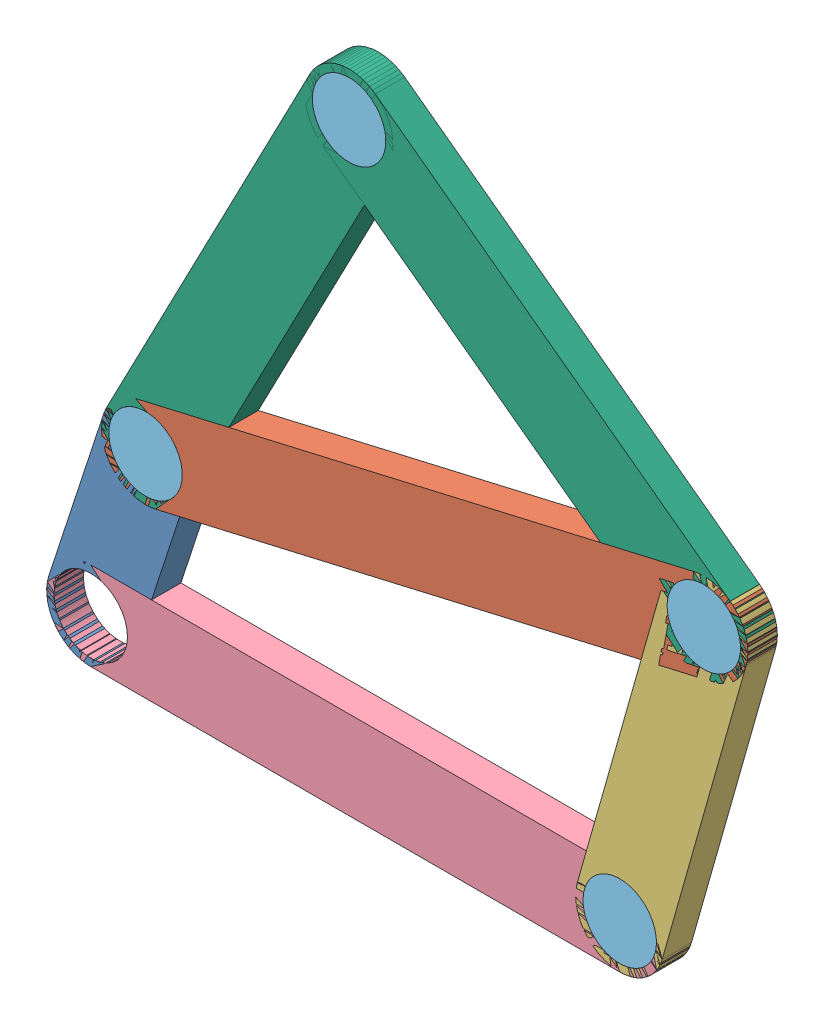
SolidWorks assembly Assem1.SLDASM, configuration Default (file format 15000). Lengths in mm.
Overall size (248.52 229.97 10).
10 component instances, 6 part files, 21 mates.
Components (placement in the parent):
- Part1-1: Part1.SLDPRT [Default] at (10.0607 72.169 89.371) x (-0.310807 -0.950473 0) z (0 0 1) size (90 30 10)
- Part2-1: Part2.SLDPRT [Default] at (200.0327 116.1647 89.371) x (-0.974216 -0.225619 0) z (0 0 1) size (225 30 10)
- Part4-1: Part4.SLDPRT [Default] at (200.0327 116.1647 89.371) x (-0.272576 -0.962134 0) z (0 0 1) size (135 30 10)
- Part6-1: Part6.SLDPRT [Default] at (-8.5877 15.1406 89.371) size (210 30 10)
- pin-5: pin.SLDPRT [Default] at (171.4123 15.1406 89.371) size (25 25 10)
- Part7-1: Part7.SLDPRT [Default] at (10.0607 72.169 89.371) x (0.461784 0.886992 0) z (0 0 1) size (180 30 10)
- Part7-2: Part7.SLDPRT [Default] at (79.3284 205.2178 89.371) x (0.804696 -0.593687 0) z (0 0 1) size (180 30 10)
- pin-6: pin.SLDPRT [Default] at (79.3284 205.2178 89.371) size (25 25 10)
- pin-7: pin.SLDPRT [Default] at (10.0607 72.169 89.371) size (25 25 10)
- pin-8: pin.SLDPRT [Default] at (200.0327 116.1647 89.371) size (25 25 10)
Mates (geometry in assembly coordinates):
- Concentric1: concentric aligned: cylinder of Part1-1 through (10.0607 72.169 99.371) axis (0 0 -1) radius 12.5; cylinder of Part2-1 through (10.0607 72.169 99.371) axis (0 0 -1) radius 12.5
- Coincident1: coincident aligned: plane of Part1-1 through (10.0607 72.169 99.371) normal (0 0 1); plane of Part2-1 through (200.0327 116.1647 99.371) normal (0 0 1)
- Concentric2: concentric aligned: cylinder of Part2-1 through (200.0327 116.1647 99.371) axis (0 0 -1) radius 12.5; cylinder of Part4-1 through (200.0327 116.1647 99.371) axis (0 0 -1) radius 12.5
- Coincident2: coincident aligned: plane of Part2-1 through (200.0327 116.1647 99.371) normal (0 0 1); plane of Part4-1 through (200.0327 116.1647 99.371) normal (0 0 1)
- Concentric7: concentric aligned: cylinder of Part1-1 through (-8.5877 15.1406 99.371) axis (0 0 -1) radius 12.5; cylinder of Part6-1 through (-8.5877 15.1406 99.371) axis (0 0 -1) radius 12.5
- Concentric8: concentric aligned: cylinder of Part4-1 through (171.4123 15.1406 99.371) axis (0 0 -1) radius 12.5; cylinder of Part6-1 through (171.4123 15.1406 99.371) axis (0 0 -1) radius 12.5
- Coincident10: coincident aligned: plane of Part4-1 through (200.0327 116.1647 99.371) normal (0 0 1); plane of Part6-1 through (-8.5877 15.1406 99.371) normal (0 0 1)
- Coincident11: coincident aligned: plane of Part1-1 through (10.0607 72.169 99.371) normal (0 0 1); plane of Part6-1 through (-8.5877 15.1406 99.371) normal (0 0 1)
- Concentric9: concentric aligned: cylinder of Part6-1 through (171.4123 15.1406 99.371) axis (0 0 -1) radius 12.5; cylinder of pin-5 through (171.4123 15.1406 99.371) axis (0 0 -1) radius 12.5
- Coincident12: coincident aligned: plane of Part6-1 through (-8.5877 15.1406 99.371) normal (0 0 1); plane of pin-5 through (171.4123 15.1406 99.371) normal (0 0 1)
- Concentric10: concentric aligned: cylinder of Part1-1 through (10.0607 72.169 99.371) axis (0 0 -1) radius 12.5; cylinder of Part7-1 through (10.0607 72.169 99.371) axis (0 0 -1) radius 12.5
- Coincident13: coincident aligned: plane of Part2-1 through (200.0327 116.1647 99.371) normal (0 0 1); plane of Part7-1 through (10.0607 72.169 99.371) normal (0 0 1)
- Concentric11: concentric aligned: cylinder of Part7-1 through (79.3284 205.2178 99.371) axis (0 0 -1) radius 12.5; cylinder of Part7-2 through (79.3284 205.2178 99.371) axis (0 0 -1) radius 12.5
- Coincident14: coincident aligned: plane of Part7-1 through (10.0607 72.169 99.371) normal (0 0 1); plane of Part7-2 through (79.3284 205.2178 99.371) normal (0 0 1)
- Coincident15: coincident anti-aligned: circle of Part4-1; cylinder of Part7-2 through (200.0327 116.1647 99.371) axis (0 0 -1) radius 12.5
- Concentric12: concentric aligned: cylinder of Part7-1 through (10.0607 72.169 99.371) axis (0 0 -1) radius 12.5; cylinder of pin-7 through (10.0607 72.169 99.371) axis (0 0 -1) radius 12.5
- Coincident16: coincident aligned: plane of Part2-1 through (200.0327 116.1647 99.371) normal (0 0 1); plane of pin-7 through (10.0607 72.169 99.371) normal (0 0 1)
- Concentric13: concentric aligned: cylinder of Part7-1 through (79.3284 205.2178 99.371) axis (0 0 -1) radius 12.5; cylinder of pin-6 through (79.3284 205.2178 99.371) axis (0 0 -1) radius 12.5
- Coincident17: coincident aligned: plane of Part7-2 through (79.3284 205.2178 99.371) normal (0 0 1); plane of pin-6 through (79.3284 205.2178 99.371) normal (0 0 1)
- Concentric14: concentric aligned: cylinder of Part7-2 through (200.0327 116.1647 99.371) axis (0 0 -1) radius 12.5; cylinder of pin-8 through (200.0327 116.1647 99.371) axis (0 0 -1) radius 12.5
- Coincident18: coincident aligned: plane of Part7-2 through (79.3284 205.2178 99.371) normal (0 0 1); plane of pin-8 through (200.0327 116.1647 99.371) normal (0 0 1)
